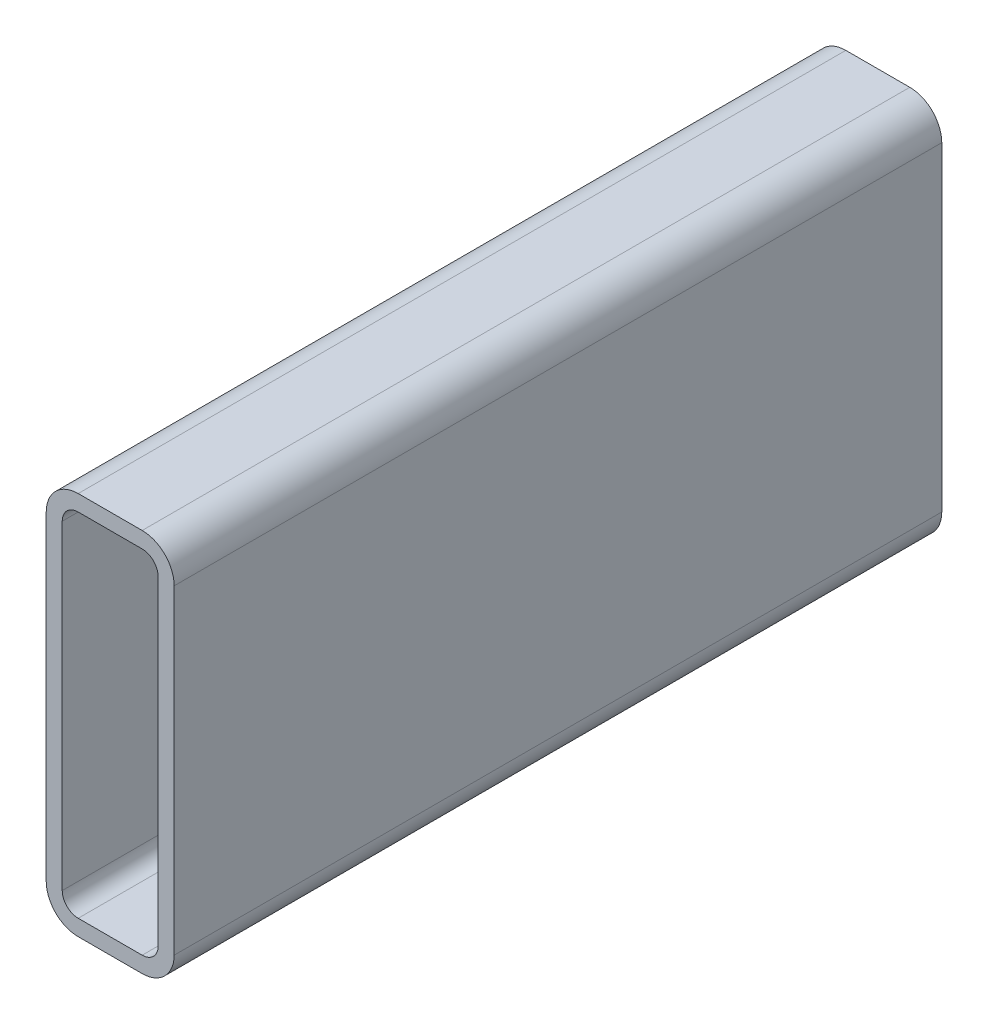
ISO-10303-21;
HEADER;
FILE_DESCRIPTION(('STEP AP214'),'2;1');
FILE_NAME('part.step','',(''),(''),'','','');
FILE_SCHEMA(('AUTOMOTIVE_DESIGN { 1 0 10303 214 1 1 1 1 }'));
ENDSEC;
DATA;
#1=APPLICATION_CONTEXT('core data for automotive mechanical design processes');
#2=APPLICATION_PROTOCOL_DEFINITION('international standard','automotive_design',2000,#1);
#3=PRODUCT_CONTEXT('',#1,'mechanical');
#4=PRODUCT('Part','Part','',(#3));
#5=PRODUCT_RELATED_PRODUCT_CATEGORY('part','',(#4));
#6=PRODUCT_DEFINITION_FORMATION('','',#4);
#7=PRODUCT_DEFINITION_CONTEXT('part definition',#1,'design');
#8=PRODUCT_DEFINITION('design','',#6,#7);
#9=PRODUCT_DEFINITION_SHAPE('','',#8);
#10=(LENGTH_UNIT() NAMED_UNIT(*) SI_UNIT(.MILLI.,.METRE.));
#11=(NAMED_UNIT(*) PLANE_ANGLE_UNIT() SI_UNIT($,.RADIAN.));
#12=(NAMED_UNIT(*) SI_UNIT($,.STERADIAN.) SOLID_ANGLE_UNIT());
#13=UNCERTAINTY_MEASURE_WITH_UNIT(LENGTH_MEASURE(1.E-05),#10,'distance_accuracy_value','');
#14=(GEOMETRIC_REPRESENTATION_CONTEXT(3) GLOBAL_UNCERTAINTY_ASSIGNED_CONTEXT((#13)) GLOBAL_UNIT_ASSIGNED_CONTEXT((#10,
#11,#12)) REPRESENTATION_CONTEXT('',''));
#15=CARTESIAN_POINT('',(0.,0.,0.));
#16=DIRECTION('',(0.,0.,1.));
#17=DIRECTION('',(1.,0.,0.));
#18=AXIS2_PLACEMENT_3D('',#15,#16,#17);
#19=CARTESIAN_POINT('',(12.7,139.7,304.8));
#20=DIRECTION('',(0.,0.,1.));
#21=DIRECTION('',(1.,0.,0.));
#22=AXIS2_PLACEMENT_3D('',#19,#20,#21);
#23=PLANE('',#22);
#24=CARTESIAN_POINT('',(12.7,139.7,304.8));
#25=DIRECTION('',(0.,0.,1.));
#26=DIRECTION('',(1.,0.,0.));
#27=AXIS2_PLACEMENT_3D('',#24,#25,#26);
#28=CIRCLE('',#27,12.7);
#29=CARTESIAN_POINT('',(12.7,152.4,304.8));
#30=VERTEX_POINT('',#29);
#31=CARTESIAN_POINT('',(0.,139.7,304.8));
#32=VERTEX_POINT('',#31);
#33=EDGE_CURVE('E211',#30,#32,#28,.T.);
#34=ORIENTED_EDGE('',*,*,#33,.T.);
#35=DIRECTION('',(0.,-1.,0.));
#36=VECTOR('',#35,1.);
#37=CARTESIAN_POINT('',(0.,12.7,304.8));
#38=LINE('',#37,#36);
#39=CARTESIAN_POINT('',(0.,12.7,304.8));
#40=VERTEX_POINT('',#39);
#41=EDGE_CURVE('E214',#32,#40,#38,.T.);
#42=ORIENTED_EDGE('',*,*,#41,.T.);
#43=CARTESIAN_POINT('',(12.7,12.7,304.8));
#44=DIRECTION('',(0.,0.,1.));
#45=DIRECTION('',(1.,0.,0.));
#46=AXIS2_PLACEMENT_3D('',#43,#44,#45);
#47=CIRCLE('',#46,12.7);
#48=CARTESIAN_POINT('',(12.7,0.,304.8));
#49=VERTEX_POINT('',#48);
#50=EDGE_CURVE('E217',#40,#49,#47,.T.);
#51=ORIENTED_EDGE('',*,*,#50,.T.);
#52=DIRECTION('',(1.,0.,0.));
#53=VECTOR('',#52,1.);
#54=CARTESIAN_POINT('',(38.1,0.,304.8));
#55=LINE('',#54,#53);
#56=CARTESIAN_POINT('',(38.1,0.,304.8));
#57=VERTEX_POINT('',#56);
#58=EDGE_CURVE('E219',#49,#57,#55,.T.);
#59=ORIENTED_EDGE('',*,*,#58,.T.);
#60=CARTESIAN_POINT('',(38.1,12.7,304.8));
#61=DIRECTION('',(0.,0.,1.));
#62=DIRECTION('',(1.,0.,0.));
#63=AXIS2_PLACEMENT_3D('',#60,#61,#62);
#64=CIRCLE('',#63,12.7);
#65=CARTESIAN_POINT('',(50.8,12.7,304.8));
#66=VERTEX_POINT('',#65);
#67=EDGE_CURVE('E221',#57,#66,#64,.T.);
#68=ORIENTED_EDGE('',*,*,#67,.T.);
#69=DIRECTION('',(0.,1.,0.));
#70=VECTOR('',#69,1.);
#71=CARTESIAN_POINT('',(50.8,139.7,304.8));
#72=LINE('',#71,#70);
#73=CARTESIAN_POINT('',(50.8,139.7,304.8));
#74=VERTEX_POINT('',#73);
#75=EDGE_CURVE('E223',#66,#74,#72,.T.);
#76=ORIENTED_EDGE('',*,*,#75,.T.);
#77=CARTESIAN_POINT('',(38.1,139.7,304.8));
#78=DIRECTION('',(0.,0.,1.));
#79=DIRECTION('',(1.,0.,0.));
#80=AXIS2_PLACEMENT_3D('',#77,#78,#79);
#81=CIRCLE('',#80,12.7);
#82=CARTESIAN_POINT('',(38.1,152.4,304.8));
#83=VERTEX_POINT('',#82);
#84=EDGE_CURVE('E225',#74,#83,#81,.T.);
#85=ORIENTED_EDGE('',*,*,#84,.T.);
#86=DIRECTION('',(-1.,0.,0.));
#87=VECTOR('',#86,1.);
#88=CARTESIAN_POINT('',(12.7,152.4,304.8));
#89=LINE('',#88,#87);
#90=EDGE_CURVE('E227',#83,#30,#89,.T.);
#91=ORIENTED_EDGE('',*,*,#90,.T.);
#92=EDGE_LOOP('',(#34,#42,#51,#59,#68,#76,#85,#91));
#93=FACE_BOUND('',#92,.T.);
#94=DIRECTION('',(0.,-1.,0.));
#95=VECTOR('',#94,1.);
#96=CARTESIAN_POINT('',(6.35,12.7,304.8));
#97=LINE('',#96,#95);
#98=CARTESIAN_POINT('',(6.35,139.7,304.8));
#99=VERTEX_POINT('',#98);
#100=CARTESIAN_POINT('',(6.35,12.7,304.8));
#101=VERTEX_POINT('',#100);
#102=EDGE_CURVE('E154',#99,#101,#97,.T.);
#103=ORIENTED_EDGE('',*,*,#102,.F.);
#104=CARTESIAN_POINT('',(12.7,139.7,304.8));
#105=DIRECTION('',(0.,0.,1.));
#106=DIRECTION('',(1.,0.,0.));
#107=AXIS2_PLACEMENT_3D('',#104,#105,#106);
#108=CIRCLE('',#107,6.35);
#109=CARTESIAN_POINT('',(12.7,146.05,304.8));
#110=VERTEX_POINT('',#109);
#111=EDGE_CURVE('E146',#110,#99,#108,.T.);
#112=ORIENTED_EDGE('',*,*,#111,.F.);
#113=DIRECTION('',(-1.,0.,0.));
#114=VECTOR('',#113,1.);
#115=CARTESIAN_POINT('',(12.7,146.05,304.8));
#116=LINE('',#115,#114);
#117=CARTESIAN_POINT('',(38.1,146.05,304.8));
#118=VERTEX_POINT('',#117);
#119=EDGE_CURVE('E179',#118,#110,#116,.T.);
#120=ORIENTED_EDGE('',*,*,#119,.F.);
#121=CARTESIAN_POINT('',(38.1,139.7,304.8));
#122=DIRECTION('',(0.,0.,1.));
#123=DIRECTION('',(1.,0.,0.));
#124=AXIS2_PLACEMENT_3D('',#121,#122,#123);
#125=CIRCLE('',#124,6.35);
#126=CARTESIAN_POINT('',(44.45,139.7,304.8));
#127=VERTEX_POINT('',#126);
#128=EDGE_CURVE('E177',#127,#118,#125,.T.);
#129=ORIENTED_EDGE('',*,*,#128,.F.);
#130=DIRECTION('',(0.,1.,0.));
#131=VECTOR('',#130,1.);
#132=CARTESIAN_POINT('',(44.45,139.7,304.8));
#133=LINE('',#132,#131);
#134=CARTESIAN_POINT('',(44.45,12.7,304.8));
#135=VERTEX_POINT('',#134);
#136=EDGE_CURVE('E175',#135,#127,#133,.T.);
#137=ORIENTED_EDGE('',*,*,#136,.F.);
#138=CARTESIAN_POINT('',(38.1,12.7,304.8));
#139=DIRECTION('',(0.,0.,1.));
#140=DIRECTION('',(1.,0.,0.));
#141=AXIS2_PLACEMENT_3D('',#138,#139,#140);
#142=CIRCLE('',#141,6.35);
#143=CARTESIAN_POINT('',(38.1,6.35,304.8));
#144=VERTEX_POINT('',#143);
#145=EDGE_CURVE('E173',#144,#135,#142,.T.);
#146=ORIENTED_EDGE('',*,*,#145,.F.);
#147=DIRECTION('',(1.,0.,0.));
#148=VECTOR('',#147,1.);
#149=CARTESIAN_POINT('',(38.1,6.35,304.8));
#150=LINE('',#149,#148);
#151=CARTESIAN_POINT('',(12.7,6.35,304.8));
#152=VERTEX_POINT('',#151);
#153=EDGE_CURVE('E169',#152,#144,#150,.T.);
#154=ORIENTED_EDGE('',*,*,#153,.F.);
#155=CARTESIAN_POINT('',(12.7,12.7,304.8));
#156=DIRECTION('',(0.,0.,1.));
#157=DIRECTION('',(1.,0.,0.));
#158=AXIS2_PLACEMENT_3D('',#155,#156,#157);
#159=CIRCLE('',#158,6.35);
#160=EDGE_CURVE('E167',#101,#152,#159,.T.);
#161=ORIENTED_EDGE('',*,*,#160,.F.);
#162=EDGE_LOOP('',(#103,#112,#120,#129,#137,#146,#154,#161));
#163=FACE_BOUND('',#162,.T.);
#164=ADVANCED_FACE('F33',(#93,#163),#23,.T.);
#165=CARTESIAN_POINT('',(12.7,139.7,0.));
#166=DIRECTION('',(0.,0.,1.));
#167=DIRECTION('',(1.,0.,0.));
#168=AXIS2_PLACEMENT_3D('',#165,#166,#167);
#169=PLANE('',#168);
#170=CARTESIAN_POINT('',(12.7,139.7,0.));
#171=DIRECTION('',(0.,0.,1.));
#172=DIRECTION('',(1.,0.,0.));
#173=AXIS2_PLACEMENT_3D('',#170,#171,#172);
#174=CIRCLE('',#173,12.7);
#175=CARTESIAN_POINT('',(12.7,152.4,0.));
#176=VERTEX_POINT('',#175);
#177=CARTESIAN_POINT('',(0.,139.7,0.));
#178=VERTEX_POINT('',#177);
#179=EDGE_CURVE('E162',#176,#178,#174,.T.);
#180=ORIENTED_EDGE('',*,*,#179,.F.);
#181=DIRECTION('',(-1.,0.,0.));
#182=VECTOR('',#181,1.);
#183=CARTESIAN_POINT('',(12.7,152.4,0.));
#184=LINE('',#183,#182);
#185=CARTESIAN_POINT('',(38.1,152.4,0.));
#186=VERTEX_POINT('',#185);
#187=EDGE_CURVE('E215',#186,#176,#184,.T.);
#188=ORIENTED_EDGE('',*,*,#187,.F.);
#189=CARTESIAN_POINT('',(38.1,139.7,0.));
#190=DIRECTION('',(0.,0.,1.));
#191=DIRECTION('',(1.,0.,0.));
#192=AXIS2_PLACEMENT_3D('',#189,#190,#191);
#193=CIRCLE('',#192,12.7);
#194=CARTESIAN_POINT('',(50.8,139.7,0.));
#195=VERTEX_POINT('',#194);
#196=EDGE_CURVE('E242',#195,#186,#193,.T.);
#197=ORIENTED_EDGE('',*,*,#196,.F.);
#198=DIRECTION('',(0.,1.,0.));
#199=VECTOR('',#198,1.);
#200=CARTESIAN_POINT('',(50.8,139.7,0.));
#201=LINE('',#200,#199);
#202=CARTESIAN_POINT('',(50.8,12.7,0.));
#203=VERTEX_POINT('',#202);
#204=EDGE_CURVE('E240',#203,#195,#201,.T.);
#205=ORIENTED_EDGE('',*,*,#204,.F.);
#206=CARTESIAN_POINT('',(38.1,12.7,0.));
#207=DIRECTION('',(0.,0.,1.));
#208=DIRECTION('',(1.,0.,0.));
#209=AXIS2_PLACEMENT_3D('',#206,#207,#208);
#210=CIRCLE('',#209,12.7);
#211=CARTESIAN_POINT('',(38.1,0.,0.));
#212=VERTEX_POINT('',#211);
#213=EDGE_CURVE('E238',#212,#203,#210,.T.);
#214=ORIENTED_EDGE('',*,*,#213,.F.);
#215=DIRECTION('',(1.,0.,0.));
#216=VECTOR('',#215,1.);
#217=CARTESIAN_POINT('',(38.1,0.,0.));
#218=LINE('',#217,#216);
#219=CARTESIAN_POINT('',(12.7,0.,0.));
#220=VERTEX_POINT('',#219);
#221=EDGE_CURVE('E236',#220,#212,#218,.T.);
#222=ORIENTED_EDGE('',*,*,#221,.F.);
#223=CARTESIAN_POINT('',(12.7,12.7,0.));
#224=DIRECTION('',(0.,0.,1.));
#225=DIRECTION('',(1.,0.,0.));
#226=AXIS2_PLACEMENT_3D('',#223,#224,#225);
#227=CIRCLE('',#226,12.7);
#228=CARTESIAN_POINT('',(0.,12.7,0.));
#229=VERTEX_POINT('',#228);
#230=EDGE_CURVE('E234',#229,#220,#227,.T.);
#231=ORIENTED_EDGE('',*,*,#230,.F.);
#232=DIRECTION('',(0.,-1.,0.));
#233=VECTOR('',#232,1.);
#234=CARTESIAN_POINT('',(0.,12.7,0.));
#235=LINE('',#234,#233);
#236=EDGE_CURVE('E232',#178,#229,#235,.T.);
#237=ORIENTED_EDGE('',*,*,#236,.F.);
#238=EDGE_LOOP('',(#180,#188,#197,#205,#214,#222,#231,#237));
#239=FACE_BOUND('',#238,.T.);
#240=CARTESIAN_POINT('',(12.7,139.7,0.));
#241=DIRECTION('',(0.,0.,1.));
#242=DIRECTION('',(1.,0.,0.));
#243=AXIS2_PLACEMENT_3D('',#240,#241,#242);
#244=CIRCLE('',#243,6.35);
#245=CARTESIAN_POINT('',(12.7,146.05,0.));
#246=VERTEX_POINT('',#245);
#247=CARTESIAN_POINT('',(6.35,139.7,0.));
#248=VERTEX_POINT('',#247);
#249=EDGE_CURVE('E56',#246,#248,#244,.T.);
#250=ORIENTED_EDGE('',*,*,#249,.T.);
#251=DIRECTION('',(0.,-1.,0.));
#252=VECTOR('',#251,1.);
#253=CARTESIAN_POINT('',(6.35,12.7,0.));
#254=LINE('',#253,#252);
#255=CARTESIAN_POINT('',(6.35,12.7,0.));
#256=VERTEX_POINT('',#255);
#257=EDGE_CURVE('E161',#248,#256,#254,.T.);
#258=ORIENTED_EDGE('',*,*,#257,.T.);
#259=CARTESIAN_POINT('',(12.7,12.7,0.));
#260=DIRECTION('',(0.,0.,1.));
#261=DIRECTION('',(1.,0.,0.));
#262=AXIS2_PLACEMENT_3D('',#259,#260,#261);
#263=CIRCLE('',#262,6.35);
#264=CARTESIAN_POINT('',(12.7,6.35,0.));
#265=VERTEX_POINT('',#264);
#266=EDGE_CURVE('E183',#256,#265,#263,.T.);
#267=ORIENTED_EDGE('',*,*,#266,.T.);
#268=DIRECTION('',(1.,0.,0.));
#269=VECTOR('',#268,1.);
#270=CARTESIAN_POINT('',(38.1,6.35,0.));
#271=LINE('',#270,#269);
#272=CARTESIAN_POINT('',(38.1,6.35,0.));
#273=VERTEX_POINT('',#272);
#274=EDGE_CURVE('E186',#265,#273,#271,.T.);
#275=ORIENTED_EDGE('',*,*,#274,.T.);
#276=CARTESIAN_POINT('',(38.1,12.7,0.));
#277=DIRECTION('',(0.,0.,1.));
#278=DIRECTION('',(1.,0.,0.));
#279=AXIS2_PLACEMENT_3D('',#276,#277,#278);
#280=CIRCLE('',#279,6.35);
#281=CARTESIAN_POINT('',(44.45,12.7,0.));
#282=VERTEX_POINT('',#281);
#283=EDGE_CURVE('E189',#273,#282,#280,.T.);
#284=ORIENTED_EDGE('',*,*,#283,.T.);
#285=DIRECTION('',(0.,1.,0.));
#286=VECTOR('',#285,1.);
#287=CARTESIAN_POINT('',(44.45,139.7,0.));
#288=LINE('',#287,#286);
#289=CARTESIAN_POINT('',(44.45,139.7,0.));
#290=VERTEX_POINT('',#289);
#291=EDGE_CURVE('E192',#282,#290,#288,.T.);
#292=ORIENTED_EDGE('',*,*,#291,.T.);
#293=CARTESIAN_POINT('',(38.1,139.7,0.));
#294=DIRECTION('',(0.,0.,1.));
#295=DIRECTION('',(1.,0.,0.));
#296=AXIS2_PLACEMENT_3D('',#293,#294,#295);
#297=CIRCLE('',#296,6.35);
#298=CARTESIAN_POINT('',(38.1,146.05,0.));
#299=VERTEX_POINT('',#298);
#300=EDGE_CURVE('E195',#290,#299,#297,.T.);
#301=ORIENTED_EDGE('',*,*,#300,.T.);
#302=DIRECTION('',(-1.,0.,0.));
#303=VECTOR('',#302,1.);
#304=CARTESIAN_POINT('',(12.7,146.05,0.));
#305=LINE('',#304,#303);
#306=EDGE_CURVE('E155',#299,#246,#305,.T.);
#307=ORIENTED_EDGE('',*,*,#306,.T.);
#308=EDGE_LOOP('',(#250,#258,#267,#275,#284,#292,#301,#307));
#309=FACE_BOUND('',#308,.T.);
#310=ADVANCED_FACE('F272',(#239,#309),#169,.F.);
#311=CARTESIAN_POINT('',(12.7,139.7,304.8));
#312=DIRECTION('',(0.,0.,-1.));
#313=DIRECTION('',(-1.,0.,0.));
#314=AXIS2_PLACEMENT_3D('',#311,#312,#313);
#315=CYLINDRICAL_SURFACE('',#314,12.7);
#316=ORIENTED_EDGE('',*,*,#179,.T.);
#317=DIRECTION('',(0.,0.,-1.));
#318=VECTOR('',#317,1.);
#319=CARTESIAN_POINT('',(0.,139.7,304.8));
#320=LINE('',#319,#318);
#321=EDGE_CURVE('E11',#32,#178,#320,.T.);
#322=ORIENTED_EDGE('',*,*,#321,.F.);
#323=ORIENTED_EDGE('',*,*,#33,.F.);
#324=DIRECTION('',(0.,0.,-1.));
#325=VECTOR('',#324,1.);
#326=CARTESIAN_POINT('',(12.7,152.4,304.8));
#327=LINE('',#326,#325);
#328=EDGE_CURVE('E229',#30,#176,#327,.T.);
#329=ORIENTED_EDGE('',*,*,#328,.T.);
#330=EDGE_LOOP('',(#316,#322,#323,#329));
#331=FACE_BOUND('',#330,.T.);
#332=ADVANCED_FACE('F35',(#331),#315,.T.);
#333=CARTESIAN_POINT('',(0.,12.7,304.8));
#334=DIRECTION('',(1.,0.,0.));
#335=DIRECTION('',(0.,0.,-1.));
#336=AXIS2_PLACEMENT_3D('',#333,#334,#335);
#337=PLANE('',#336);
#338=ORIENTED_EDGE('',*,*,#236,.T.);
#339=DIRECTION('',(0.,0.,-1.));
#340=VECTOR('',#339,1.);
#341=CARTESIAN_POINT('',(0.,12.7,304.8));
#342=LINE('',#341,#340);
#343=EDGE_CURVE('E41',#40,#229,#342,.T.);
#344=ORIENTED_EDGE('',*,*,#343,.F.);
#345=ORIENTED_EDGE('',*,*,#41,.F.);
#346=ORIENTED_EDGE('',*,*,#321,.T.);
#347=EDGE_LOOP('',(#338,#344,#345,#346));
#348=FACE_BOUND('',#347,.T.);
#349=ADVANCED_FACE('F289',(#348),#337,.F.);
#350=CARTESIAN_POINT('',(12.7,12.7,304.8));
#351=DIRECTION('',(0.,0.,-1.));
#352=DIRECTION('',(-1.,0.,0.));
#353=AXIS2_PLACEMENT_3D('',#350,#351,#352);
#354=CYLINDRICAL_SURFACE('',#353,12.7);
#355=ORIENTED_EDGE('',*,*,#230,.T.);
#356=DIRECTION('',(0.,0.,-1.));
#357=VECTOR('',#356,1.);
#358=CARTESIAN_POINT('',(12.7,0.,304.8));
#359=LINE('',#358,#357);
#360=EDGE_CURVE('E259',#49,#220,#359,.T.);
#361=ORIENTED_EDGE('',*,*,#360,.F.);
#362=ORIENTED_EDGE('',*,*,#50,.F.);
#363=ORIENTED_EDGE('',*,*,#343,.T.);
#364=EDGE_LOOP('',(#355,#361,#362,#363));
#365=FACE_BOUND('',#364,.T.);
#366=ADVANCED_FACE('F266',(#365),#354,.T.);
#367=CARTESIAN_POINT('',(38.1,0.,304.8));
#368=DIRECTION('',(0.,1.,0.));
#369=DIRECTION('',(0.,0.,1.));
#370=AXIS2_PLACEMENT_3D('',#367,#368,#369);
#371=PLANE('',#370);
#372=ORIENTED_EDGE('',*,*,#221,.T.);
#373=DIRECTION('',(0.,0.,-1.));
#374=VECTOR('',#373,1.);
#375=CARTESIAN_POINT('',(38.1,0.,304.8));
#376=LINE('',#375,#374);
#377=EDGE_CURVE('E256',#57,#212,#376,.T.);
#378=ORIENTED_EDGE('',*,*,#377,.F.);
#379=ORIENTED_EDGE('',*,*,#58,.F.);
#380=ORIENTED_EDGE('',*,*,#360,.T.);
#381=EDGE_LOOP('',(#372,#378,#379,#380));
#382=FACE_BOUND('',#381,.T.);
#383=ADVANCED_FACE('F278',(#382),#371,.F.);
#384=CARTESIAN_POINT('',(38.1,12.7,304.8));
#385=DIRECTION('',(0.,0.,-1.));
#386=DIRECTION('',(-1.,0.,0.));
#387=AXIS2_PLACEMENT_3D('',#384,#385,#386);
#388=CYLINDRICAL_SURFACE('',#387,12.7);
#389=ORIENTED_EDGE('',*,*,#213,.T.);
#390=DIRECTION('',(0.,0.,-1.));
#391=VECTOR('',#390,1.);
#392=CARTESIAN_POINT('',(50.8,12.7,304.8));
#393=LINE('',#392,#391);
#394=EDGE_CURVE('E253',#66,#203,#393,.T.);
#395=ORIENTED_EDGE('',*,*,#394,.F.);
#396=ORIENTED_EDGE('',*,*,#67,.F.);
#397=ORIENTED_EDGE('',*,*,#377,.T.);
#398=EDGE_LOOP('',(#389,#395,#396,#397));
#399=FACE_BOUND('',#398,.T.);
#400=ADVANCED_FACE('F282',(#399),#388,.T.);
#401=CARTESIAN_POINT('',(50.8,139.7,304.8));
#402=DIRECTION('',(-1.,0.,0.));
#403=DIRECTION('',(0.,0.,1.));
#404=AXIS2_PLACEMENT_3D('',#401,#402,#403);
#405=PLANE('',#404);
#406=ORIENTED_EDGE('',*,*,#204,.T.);
#407=DIRECTION('',(0.,0.,-1.));
#408=VECTOR('',#407,1.);
#409=CARTESIAN_POINT('',(50.8,139.7,304.8));
#410=LINE('',#409,#408);
#411=EDGE_CURVE('E250',#74,#195,#410,.T.);
#412=ORIENTED_EDGE('',*,*,#411,.F.);
#413=ORIENTED_EDGE('',*,*,#75,.F.);
#414=ORIENTED_EDGE('',*,*,#394,.T.);
#415=EDGE_LOOP('',(#406,#412,#413,#414));
#416=FACE_BOUND('',#415,.T.);
#417=ADVANCED_FACE('F302',(#416),#405,.F.);
#418=CARTESIAN_POINT('',(38.1,139.7,304.8));
#419=DIRECTION('',(0.,0.,-1.));
#420=DIRECTION('',(-1.,0.,0.));
#421=AXIS2_PLACEMENT_3D('',#418,#419,#420);
#422=CYLINDRICAL_SURFACE('',#421,12.7);
#423=ORIENTED_EDGE('',*,*,#196,.T.);
#424=DIRECTION('',(0.,0.,-1.));
#425=VECTOR('',#424,1.);
#426=CARTESIAN_POINT('',(38.1,152.4,304.8));
#427=LINE('',#426,#425);
#428=EDGE_CURVE('E247',#83,#186,#427,.T.);
#429=ORIENTED_EDGE('',*,*,#428,.F.);
#430=ORIENTED_EDGE('',*,*,#84,.F.);
#431=ORIENTED_EDGE('',*,*,#411,.T.);
#432=EDGE_LOOP('',(#423,#429,#430,#431));
#433=FACE_BOUND('',#432,.T.);
#434=ADVANCED_FACE('F300',(#433),#422,.T.);
#435=CARTESIAN_POINT('',(12.7,152.4,304.8));
#436=DIRECTION('',(0.,-1.,0.));
#437=DIRECTION('',(0.,0.,-1.));
#438=AXIS2_PLACEMENT_3D('',#435,#436,#437);
#439=PLANE('',#438);
#440=ORIENTED_EDGE('',*,*,#187,.T.);
#441=ORIENTED_EDGE('',*,*,#328,.F.);
#442=ORIENTED_EDGE('',*,*,#90,.F.);
#443=ORIENTED_EDGE('',*,*,#428,.T.);
#444=EDGE_LOOP('',(#440,#441,#442,#443));
#445=FACE_BOUND('',#444,.T.);
#446=ADVANCED_FACE('F295',(#445),#439,.F.);
#447=CARTESIAN_POINT('',(12.7,139.7,304.8));
#448=DIRECTION('',(0.,0.,-1.));
#449=DIRECTION('',(-1.,0.,0.));
#450=AXIS2_PLACEMENT_3D('',#447,#448,#449);
#451=CYLINDRICAL_SURFACE('',#450,6.35);
#452=ORIENTED_EDGE('',*,*,#249,.F.);
#453=DIRECTION('',(0.,0.,-1.));
#454=VECTOR('',#453,1.);
#455=CARTESIAN_POINT('',(12.7,146.05,304.8));
#456=LINE('',#455,#454);
#457=EDGE_CURVE('E150',#110,#246,#456,.T.);
#458=ORIENTED_EDGE('',*,*,#457,.F.);
#459=ORIENTED_EDGE('',*,*,#111,.T.);
#460=DIRECTION('',(0.,0.,-1.));
#461=VECTOR('',#460,1.);
#462=CARTESIAN_POINT('',(6.35,139.7,304.8));
#463=LINE('',#462,#461);
#464=EDGE_CURVE('E149',#99,#248,#463,.T.);
#465=ORIENTED_EDGE('',*,*,#464,.T.);
#466=EDGE_LOOP('',(#452,#458,#459,#465));
#467=FACE_BOUND('',#466,.T.);
#468=ADVANCED_FACE('F148',(#467),#451,.F.);
#469=CARTESIAN_POINT('',(6.35,12.7,304.8));
#470=DIRECTION('',(1.,0.,0.));
#471=DIRECTION('',(0.,0.,-1.));
#472=AXIS2_PLACEMENT_3D('',#469,#470,#471);
#473=PLANE('',#472);
#474=ORIENTED_EDGE('',*,*,#257,.F.);
#475=ORIENTED_EDGE('',*,*,#464,.F.);
#476=ORIENTED_EDGE('',*,*,#102,.T.);
#477=DIRECTION('',(0.,0.,-1.));
#478=VECTOR('',#477,1.);
#479=CARTESIAN_POINT('',(6.35,12.7,304.8));
#480=LINE('',#479,#478);
#481=EDGE_CURVE('E163',#101,#256,#480,.T.);
#482=ORIENTED_EDGE('',*,*,#481,.T.);
#483=EDGE_LOOP('',(#474,#475,#476,#482));
#484=FACE_BOUND('',#483,.T.);
#485=ADVANCED_FACE('F158',(#484),#473,.T.);
#486=CARTESIAN_POINT('',(12.7,12.7,304.8));
#487=DIRECTION('',(0.,0.,-1.));
#488=DIRECTION('',(-1.,0.,0.));
#489=AXIS2_PLACEMENT_3D('',#486,#487,#488);
#490=CYLINDRICAL_SURFACE('',#489,6.35);
#491=ORIENTED_EDGE('',*,*,#266,.F.);
#492=ORIENTED_EDGE('',*,*,#481,.F.);
#493=ORIENTED_EDGE('',*,*,#160,.T.);
#494=DIRECTION('',(0.,0.,-1.));
#495=VECTOR('',#494,1.);
#496=CARTESIAN_POINT('',(12.7,6.35,304.8));
#497=LINE('',#496,#495);
#498=EDGE_CURVE('E208',#152,#265,#497,.T.);
#499=ORIENTED_EDGE('',*,*,#498,.T.);
#500=EDGE_LOOP('',(#491,#492,#493,#499));
#501=FACE_BOUND('',#500,.T.);
#502=ADVANCED_FACE('F327',(#501),#490,.F.);
#503=CARTESIAN_POINT('',(38.1,6.35,304.8));
#504=DIRECTION('',(0.,1.,0.));
#505=DIRECTION('',(0.,0.,1.));
#506=AXIS2_PLACEMENT_3D('',#503,#504,#505);
#507=PLANE('',#506);
#508=ORIENTED_EDGE('',*,*,#274,.F.);
#509=ORIENTED_EDGE('',*,*,#498,.F.);
#510=ORIENTED_EDGE('',*,*,#153,.T.);
#511=DIRECTION('',(0.,0.,-1.));
#512=VECTOR('',#511,1.);
#513=CARTESIAN_POINT('',(38.1,6.35,304.8));
#514=LINE('',#513,#512);
#515=EDGE_CURVE('E206',#144,#273,#514,.T.);
#516=ORIENTED_EDGE('',*,*,#515,.T.);
#517=EDGE_LOOP('',(#508,#509,#510,#516));
#518=FACE_BOUND('',#517,.T.);
#519=ADVANCED_FACE('F331',(#518),#507,.T.);
#520=CARTESIAN_POINT('',(38.1,12.7,304.8));
#521=DIRECTION('',(0.,0.,-1.));
#522=DIRECTION('',(-1.,0.,0.));
#523=AXIS2_PLACEMENT_3D('',#520,#521,#522);
#524=CYLINDRICAL_SURFACE('',#523,6.35);
#525=ORIENTED_EDGE('',*,*,#283,.F.);
#526=ORIENTED_EDGE('',*,*,#515,.F.);
#527=ORIENTED_EDGE('',*,*,#145,.T.);
#528=DIRECTION('',(0.,0.,-1.));
#529=VECTOR('',#528,1.);
#530=CARTESIAN_POINT('',(44.45,12.7,304.8));
#531=LINE('',#530,#529);
#532=EDGE_CURVE('E204',#135,#282,#531,.T.);
#533=ORIENTED_EDGE('',*,*,#532,.T.);
#534=EDGE_LOOP('',(#525,#526,#527,#533));
#535=FACE_BOUND('',#534,.T.);
#536=ADVANCED_FACE('F337',(#535),#524,.F.);
#537=CARTESIAN_POINT('',(44.45,139.7,304.8));
#538=DIRECTION('',(-1.,0.,0.));
#539=DIRECTION('',(0.,0.,1.));
#540=AXIS2_PLACEMENT_3D('',#537,#538,#539);
#541=PLANE('',#540);
#542=ORIENTED_EDGE('',*,*,#291,.F.);
#543=ORIENTED_EDGE('',*,*,#532,.F.);
#544=ORIENTED_EDGE('',*,*,#136,.T.);
#545=DIRECTION('',(0.,0.,-1.));
#546=VECTOR('',#545,1.);
#547=CARTESIAN_POINT('',(44.45,139.7,304.8));
#548=LINE('',#547,#546);
#549=EDGE_CURVE('E202',#127,#290,#548,.T.);
#550=ORIENTED_EDGE('',*,*,#549,.T.);
#551=EDGE_LOOP('',(#542,#543,#544,#550));
#552=FACE_BOUND('',#551,.T.);
#553=ADVANCED_FACE('F341',(#552),#541,.T.);
#554=CARTESIAN_POINT('',(38.1,139.7,304.8));
#555=DIRECTION('',(0.,0.,-1.));
#556=DIRECTION('',(-1.,0.,0.));
#557=AXIS2_PLACEMENT_3D('',#554,#555,#556);
#558=CYLINDRICAL_SURFACE('',#557,6.35);
#559=ORIENTED_EDGE('',*,*,#300,.F.);
#560=ORIENTED_EDGE('',*,*,#549,.F.);
#561=ORIENTED_EDGE('',*,*,#128,.T.);
#562=DIRECTION('',(0.,0.,-1.));
#563=VECTOR('',#562,1.);
#564=CARTESIAN_POINT('',(38.1,146.05,304.8));
#565=LINE('',#564,#563);
#566=EDGE_CURVE('E48',#118,#299,#565,.T.);
#567=ORIENTED_EDGE('',*,*,#566,.T.);
#568=EDGE_LOOP('',(#559,#560,#561,#567));
#569=FACE_BOUND('',#568,.T.);
#570=ADVANCED_FACE('F345',(#569),#558,.F.);
#571=CARTESIAN_POINT('',(12.7,146.05,304.8));
#572=DIRECTION('',(0.,-1.,0.));
#573=DIRECTION('',(0.,0.,-1.));
#574=AXIS2_PLACEMENT_3D('',#571,#572,#573);
#575=PLANE('',#574);
#576=ORIENTED_EDGE('',*,*,#306,.F.);
#577=ORIENTED_EDGE('',*,*,#566,.F.);
#578=ORIENTED_EDGE('',*,*,#119,.T.);
#579=ORIENTED_EDGE('',*,*,#457,.T.);
#580=EDGE_LOOP('',(#576,#577,#578,#579));
#581=FACE_BOUND('',#580,.T.);
#582=ADVANCED_FACE('F349',(#581),#575,.T.);
#583=CLOSED_SHELL('',(#164,#310,#332,#349,#366,#383,#400,#417,#434,#446,#468,#485,#502,#519,
#536,#553,#570,#582));
#584=MANIFOLD_SOLID_BREP('B2',#583);
#585=ADVANCED_BREP_SHAPE_REPRESENTATION('',(#18,#584),#14);
#586=SHAPE_DEFINITION_REPRESENTATION(#9,#585);
ENDSEC;
END-ISO-10303-21;
